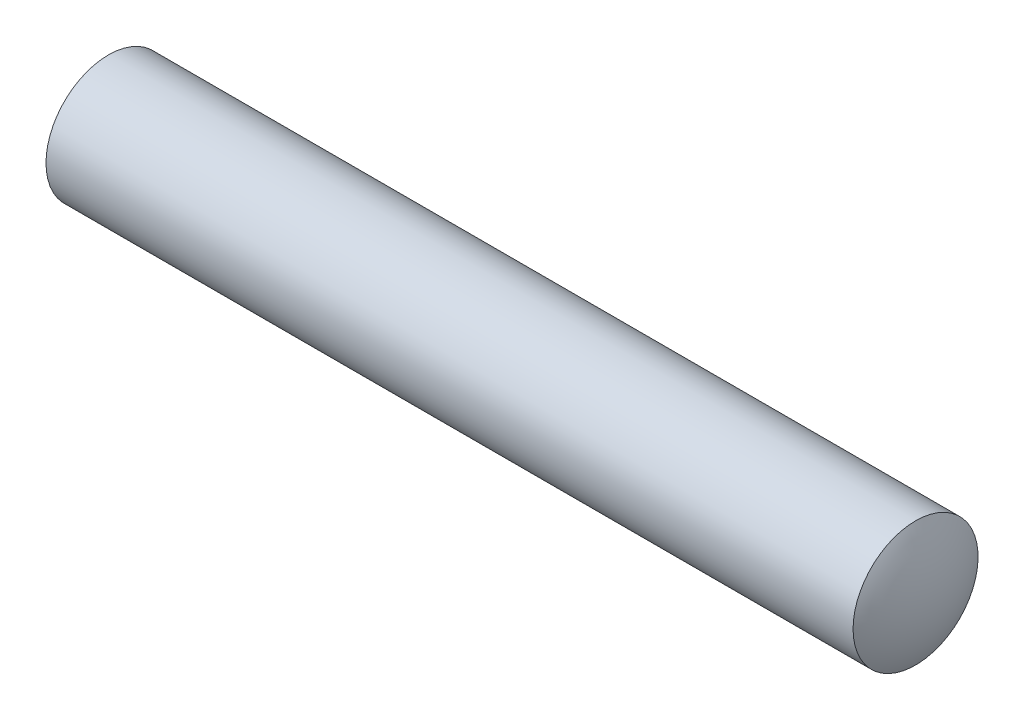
from build123d import *


with BuildPart() as part:
    # Esquisse2 → Base-R_volution (revolve)
    with BuildSketch(Plane.XY):
        with BuildLine():
            Line((0, 0), (40, 0))
            ThreePointArc((40, 0), (39.799268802, 1.538987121), (39.210506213, 2.975))
            Line((39.210506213, 2.975), (0.789493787, 2.975))
            ThreePointArc((0.789493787, 2.975), (0.200731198, 1.538987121), (0, 0))
        make_face()
    revolve(axis=Axis((18, 0, 0), (1, 0, 0)))


solid = part.part
